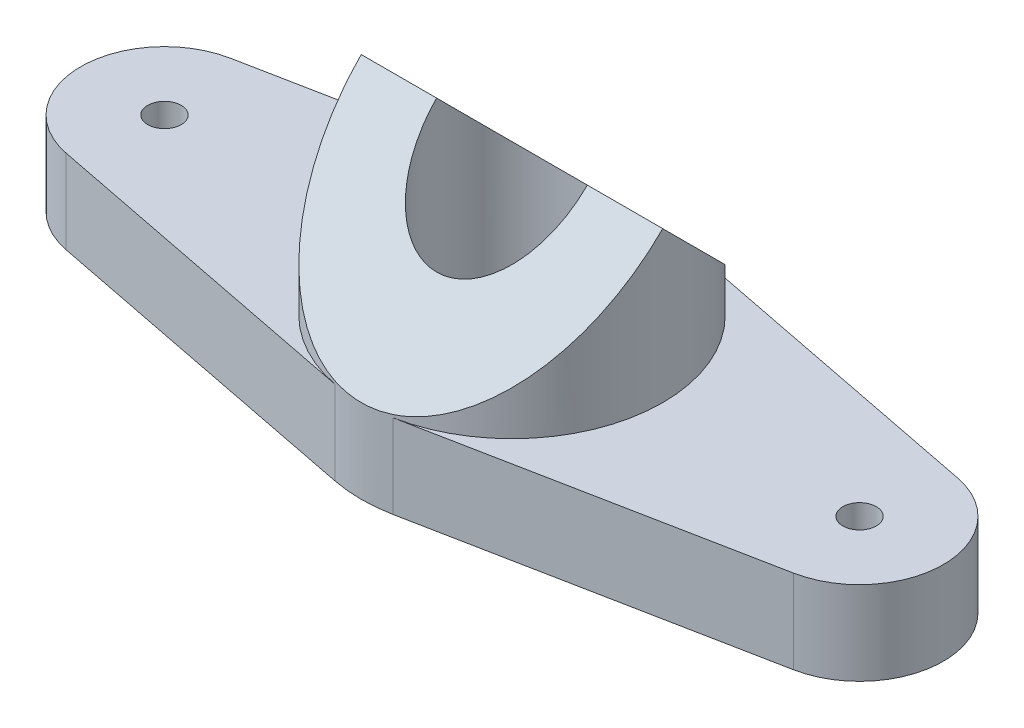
ISO-10303-21;
HEADER;
FILE_DESCRIPTION(('STEP AP214'),'2;1');
FILE_NAME('part.step','',(''),(''),'','','');
FILE_SCHEMA(('AUTOMOTIVE_DESIGN { 1 0 10303 214 1 1 1 1 }'));
ENDSEC;
DATA;
#1=APPLICATION_CONTEXT('core data for automotive mechanical design processes');
#2=APPLICATION_PROTOCOL_DEFINITION('international standard','automotive_design',2000,#1);
#3=PRODUCT_CONTEXT('',#1,'mechanical');
#4=PRODUCT('Part','Part','',(#3));
#5=PRODUCT_RELATED_PRODUCT_CATEGORY('part','',(#4));
#6=PRODUCT_DEFINITION_FORMATION('','',#4);
#7=PRODUCT_DEFINITION_CONTEXT('part definition',#1,'design');
#8=PRODUCT_DEFINITION('design','',#6,#7);
#9=PRODUCT_DEFINITION_SHAPE('','',#8);
#10=(LENGTH_UNIT() NAMED_UNIT(*) SI_UNIT(.MILLI.,.METRE.));
#11=(NAMED_UNIT(*) PLANE_ANGLE_UNIT() SI_UNIT($,.RADIAN.));
#12=(NAMED_UNIT(*) SI_UNIT($,.STERADIAN.) SOLID_ANGLE_UNIT());
#13=UNCERTAINTY_MEASURE_WITH_UNIT(LENGTH_MEASURE(1.E-05),#10,'distance_accuracy_value','');
#14=(GEOMETRIC_REPRESENTATION_CONTEXT(3) GLOBAL_UNCERTAINTY_ASSIGNED_CONTEXT((#13)) GLOBAL_UNIT_ASSIGNED_CONTEXT((#10,
#11,#12)) REPRESENTATION_CONTEXT('',''));
#15=CARTESIAN_POINT('',(0.,0.,0.));
#16=DIRECTION('',(0.,0.,1.));
#17=DIRECTION('',(1.,0.,0.));
#18=AXIS2_PLACEMENT_3D('',#15,#16,#17);
#19=CARTESIAN_POINT('',(-30.9,14.,0.));
#20=DIRECTION('',(0.,-0.707106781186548,0.707106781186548));
#21=DIRECTION('',(0.,-0.707106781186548,-0.707106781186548));
#22=AXIS2_PLACEMENT_3D('',#19,#20,#21);
#23=PLANE('',#22);
#24=DIRECTION('',(1.,0.,0.));
#25=VECTOR('',#24,1.);
#26=CARTESIAN_POINT('',(-30.9,14.,0.));
#27=LINE('',#26,#25);
#28=CARTESIAN_POINT('',(-8.99999999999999,14.,0.));
#29=VERTEX_POINT('',#28);
#30=CARTESIAN_POINT('',(-4.49999999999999,14.,0.));
#31=VERTEX_POINT('',#30);
#32=EDGE_CURVE('E317',#29,#31,#27,.T.);
#33=ORIENTED_EDGE('',*,*,#32,.T.);
#34=CARTESIAN_POINT('',(0.,14.,0.));
#35=DIRECTION('',(0.,-0.707106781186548,0.707106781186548));
#36=DIRECTION('',(0.,0.707106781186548,0.707106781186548));
#37=AXIS2_PLACEMENT_3D('',#34,#35,#36);
#38=ELLIPSE('',#37,6.36396103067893,4.5);
#39=CARTESIAN_POINT('',(4.50000000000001,14.,0.));
#40=VERTEX_POINT('',#39);
#41=EDGE_CURVE('E151',#31,#40,#38,.T.);
#42=ORIENTED_EDGE('',*,*,#41,.T.);
#43=DIRECTION('',(1.,0.,0.));
#44=VECTOR('',#43,1.);
#45=CARTESIAN_POINT('',(-30.9,14.,0.));
#46=LINE('',#45,#44);
#47=CARTESIAN_POINT('',(9.00000000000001,14.,0.));
#48=VERTEX_POINT('',#47);
#49=EDGE_CURVE('E109',#40,#48,#46,.T.);
#50=ORIENTED_EDGE('',*,*,#49,.T.);
#51=CARTESIAN_POINT('',(0.,14.,0.));
#52=DIRECTION('',(0.,-0.707106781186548,0.707106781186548));
#53=DIRECTION('',(0.,0.707106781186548,0.707106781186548));
#54=AXIS2_PLACEMENT_3D('',#51,#52,#53);
#55=ELLIPSE('',#54,12.7279220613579,9.);
#56=EDGE_CURVE('E160',#29,#48,#55,.T.);
#57=ORIENTED_EDGE('',*,*,#56,.F.);
#58=EDGE_LOOP('',(#33,#42,#50,#57));
#59=FACE_BOUND('',#58,.T.);
#60=ADVANCED_FACE('F16',(#59),#23,.F.);
#61=CARTESIAN_POINT('',(-30.9,5.,9.));
#62=DIRECTION('',(0.,-0.707106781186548,-0.707106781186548));
#63=DIRECTION('',(0.,0.707106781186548,-0.707106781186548));
#64=AXIS2_PLACEMENT_3D('',#61,#62,#63);
#65=PLANE('',#64);
#66=CARTESIAN_POINT('',(0.,14.,0.));
#67=DIRECTION('',(0.,-0.707106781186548,-0.707106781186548));
#68=DIRECTION('',(0.,0.707106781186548,-0.707106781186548));
#69=AXIS2_PLACEMENT_3D('',#66,#67,#68);
#70=ELLIPSE('',#69,6.36396103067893,4.5);
#71=EDGE_CURVE('E148',#40,#31,#70,.T.);
#72=ORIENTED_EDGE('',*,*,#71,.T.);
#73=ORIENTED_EDGE('',*,*,#32,.F.);
#74=CARTESIAN_POINT('',(0.,14.,0.));
#75=DIRECTION('',(0.,-0.707106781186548,-0.707106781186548));
#76=DIRECTION('',(0.,0.707106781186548,-0.707106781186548));
#77=AXIS2_PLACEMENT_3D('',#74,#75,#76);
#78=ELLIPSE('',#77,12.7279220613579,9.);
#79=EDGE_CURVE('E157',#48,#29,#78,.T.);
#80=ORIENTED_EDGE('',*,*,#79,.F.);
#81=ORIENTED_EDGE('',*,*,#49,.F.);
#82=EDGE_LOOP('',(#72,#73,#80,#81));
#83=FACE_BOUND('',#82,.T.);
#84=ADVANCED_FACE('F243',(#83),#65,.F.);
#85=CARTESIAN_POINT('',(0.,5.,0.));
#86=DIRECTION('',(0.,1.,0.));
#87=DIRECTION('',(0.,0.,1.));
#88=AXIS2_PLACEMENT_3D('',#85,#86,#87);
#89=PLANE('',#88);
#90=CARTESIAN_POINT('',(-20.75,5.,0.));
#91=DIRECTION('',(0.,1.,0.));
#92=DIRECTION('',(0.,0.,1.));
#93=AXIS2_PLACEMENT_3D('',#90,#91,#92);
#94=CIRCLE('',#93,1.);
#95=CARTESIAN_POINT('',(-20.75,5.,1.));
#96=VERTEX_POINT('',#95);
#97=EDGE_CURVE('E145',#96,#96,#94,.F.);
#98=ORIENTED_EDGE('',*,*,#97,.T.);
#99=EDGE_LOOP('',(#98));
#100=FACE_BOUND('',#99,.T.);
#101=DIRECTION('',(0.981243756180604,0.,0.192771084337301));
#102=VECTOR('',#101,1.);
#103=CARTESIAN_POINT('',(-21.71385542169,5.,4.906218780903));
#104=LINE('',#103,#102);
#105=CARTESIAN_POINT('',(-1.73493975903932,5.,8.83119380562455));
#106=VERTEX_POINT('',#105);
#107=CARTESIAN_POINT('',(-21.7138554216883,5.,4.90621878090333));
#108=VERTEX_POINT('',#107);
#109=EDGE_CURVE('E122',#106,#108,#104,.F.);
#110=ORIENTED_EDGE('',*,*,#109,.F.);
#111=CARTESIAN_POINT('',(0.,5.,0.));
#112=DIRECTION('',(0.,1.,0.));
#113=DIRECTION('',(0.,0.,1.));
#114=AXIS2_PLACEMENT_3D('',#111,#112,#113);
#115=CIRCLE('',#114,9.);
#116=CARTESIAN_POINT('',(-1.73493975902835,5.,-8.83119380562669));
#117=VERTEX_POINT('',#116);
#118=EDGE_CURVE('E163',#117,#106,#115,.T.);
#119=ORIENTED_EDGE('',*,*,#118,.F.);
#120=DIRECTION('',(-0.981243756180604,0.,0.192771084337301));
#121=VECTOR('',#120,1.);
#122=CARTESIAN_POINT('',(-1.734939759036,5.,-8.831193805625));
#123=LINE('',#122,#121);
#124=CARTESIAN_POINT('',(-21.7138554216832,5.,-4.90621878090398));
#125=VERTEX_POINT('',#124);
#126=EDGE_CURVE('E113',#125,#117,#123,.F.);
#127=ORIENTED_EDGE('',*,*,#126,.F.);
#128=CARTESIAN_POINT('',(-20.75,5.,0.));
#129=DIRECTION('',(0.,1.,0.));
#130=DIRECTION('',(0.,0.,1.));
#131=AXIS2_PLACEMENT_3D('',#128,#129,#130);
#132=CIRCLE('',#131,5.);
#133=EDGE_CURVE('E115',#108,#125,#132,.F.);
#134=ORIENTED_EDGE('',*,*,#133,.F.);
#135=EDGE_LOOP('',(#110,#119,#127,#134));
#136=FACE_BOUND('',#135,.T.);
#137=ADVANCED_FACE('F241',(#100,#136),#89,.T.);
#138=CARTESIAN_POINT('',(0.,5.,0.));
#139=DIRECTION('',(0.,1.,0.));
#140=DIRECTION('',(0.,0.,1.));
#141=AXIS2_PLACEMENT_3D('',#138,#139,#140);
#142=PLANE('',#141);
#143=CARTESIAN_POINT('',(20.75,5.,0.));
#144=DIRECTION('',(0.,1.,0.));
#145=DIRECTION('',(0.,0.,1.));
#146=AXIS2_PLACEMENT_3D('',#143,#144,#145);
#147=CIRCLE('',#146,1.);
#148=CARTESIAN_POINT('',(20.75,5.,1.));
#149=VERTEX_POINT('',#148);
#150=EDGE_CURVE('E142',#149,#149,#147,.F.);
#151=ORIENTED_EDGE('',*,*,#150,.T.);
#152=EDGE_LOOP('',(#151));
#153=FACE_BOUND('',#152,.T.);
#154=CARTESIAN_POINT('',(20.75,5.,0.));
#155=DIRECTION('',(0.,1.,0.));
#156=DIRECTION('',(0.,0.,1.));
#157=AXIS2_PLACEMENT_3D('',#154,#155,#156);
#158=CIRCLE('',#157,5.);
#159=CARTESIAN_POINT('',(21.7138554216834,5.,-4.90621878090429));
#160=VERTEX_POINT('',#159);
#161=CARTESIAN_POINT('',(21.7138554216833,5.,4.90621878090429));
#162=VERTEX_POINT('',#161);
#163=EDGE_CURVE('E20',#160,#162,#158,.F.);
#164=ORIENTED_EDGE('',*,*,#163,.F.);
#165=DIRECTION('',(-0.981243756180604,0.,-0.192771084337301));
#166=VECTOR('',#165,1.);
#167=CARTESIAN_POINT('',(21.71385542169,5.,-4.906218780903));
#168=LINE('',#167,#166);
#169=CARTESIAN_POINT('',(1.73493975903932,5.,-8.83119380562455));
#170=VERTEX_POINT('',#169);
#171=EDGE_CURVE('E91',#170,#160,#168,.F.);
#172=ORIENTED_EDGE('',*,*,#171,.F.);
#173=CARTESIAN_POINT('',(0.,5.,0.));
#174=DIRECTION('',(0.,1.,0.));
#175=DIRECTION('',(0.,0.,1.));
#176=AXIS2_PLACEMENT_3D('',#173,#174,#175);
#177=CIRCLE('',#176,9.);
#178=CARTESIAN_POINT('',(1.73493975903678,5.,8.83119380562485));
#179=VERTEX_POINT('',#178);
#180=EDGE_CURVE('E155',#179,#170,#177,.T.);
#181=ORIENTED_EDGE('',*,*,#180,.F.);
#182=DIRECTION('',(0.981243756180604,0.,-0.192771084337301));
#183=VECTOR('',#182,1.);
#184=CARTESIAN_POINT('',(1.734939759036,5.,8.831193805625));
#185=LINE('',#184,#183);
#186=EDGE_CURVE('E105',#162,#179,#185,.F.);
#187=ORIENTED_EDGE('',*,*,#186,.F.);
#188=EDGE_LOOP('',(#164,#172,#181,#187));
#189=FACE_BOUND('',#188,.T.);
#190=ADVANCED_FACE('F104',(#153,#189),#142,.T.);
#191=CARTESIAN_POINT('',(20.75,0.,0.));
#192=DIRECTION('',(0.,1.,0.));
#193=DIRECTION('',(0.,0.,1.));
#194=AXIS2_PLACEMENT_3D('',#191,#192,#193);
#195=CYLINDRICAL_SURFACE('',#194,5.);
#196=DIRECTION('',(0.,1.,0.));
#197=VECTOR('',#196,1.);
#198=CARTESIAN_POINT('',(21.71385542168,0.,4.90621878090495));
#199=LINE('',#198,#197);
#200=CARTESIAN_POINT('',(21.7138554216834,0.,4.90621878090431));
#201=VERTEX_POINT('',#200);
#202=EDGE_CURVE('E154',#201,#162,#199,.T.);
#203=ORIENTED_EDGE('',*,*,#202,.F.);
#204=CARTESIAN_POINT('',(20.75,0.,0.));
#205=DIRECTION('',(0.,1.,0.));
#206=DIRECTION('',(0.,0.,1.));
#207=AXIS2_PLACEMENT_3D('',#204,#205,#206);
#208=CIRCLE('',#207,5.);
#209=CARTESIAN_POINT('',(21.7138554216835,0.,-4.90621878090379));
#210=VERTEX_POINT('',#209);
#211=EDGE_CURVE('E112',#201,#210,#208,.T.);
#212=ORIENTED_EDGE('',*,*,#211,.T.);
#213=DIRECTION('',(0.,1.,0.));
#214=VECTOR('',#213,1.);
#215=CARTESIAN_POINT('',(21.7138554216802,0.,-4.90621878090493));
#216=LINE('',#215,#214);
#217=EDGE_CURVE('E96',#160,#210,#216,.F.);
#218=ORIENTED_EDGE('',*,*,#217,.F.);
#219=ORIENTED_EDGE('',*,*,#163,.T.);
#220=EDGE_LOOP('',(#203,#212,#218,#219));
#221=FACE_BOUND('',#220,.T.);
#222=ADVANCED_FACE('F111',(#221),#195,.T.);
#223=CARTESIAN_POINT('',(21.71385542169,0.,-4.906218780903));
#224=DIRECTION('',(0.192771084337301,0.,-0.981243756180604));
#225=DIRECTION('',(-0.981243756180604,0.,-0.192771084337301));
#226=AXIS2_PLACEMENT_3D('',#223,#224,#225);
#227=PLANE('',#226);
#228=DIRECTION('',(-0.981243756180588,0.,-0.192771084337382));
#229=VECTOR('',#228,1.);
#230=CARTESIAN_POINT('',(21.71385542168,0.,-4.906218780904));
#231=LINE('',#230,#229);
#232=CARTESIAN_POINT('',(1.73493975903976,0.,-8.83119380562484));
#233=VERTEX_POINT('',#232);
#234=EDGE_CURVE('E140',#210,#233,#231,.T.);
#235=ORIENTED_EDGE('',*,*,#234,.T.);
#236=DIRECTION('',(0.,1.,0.));
#237=VECTOR('',#236,1.);
#238=CARTESIAN_POINT('',(1.734939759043,0.,-8.83119380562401));
#239=LINE('',#238,#237);
#240=EDGE_CURVE('E98',#170,#233,#239,.F.);
#241=ORIENTED_EDGE('',*,*,#240,.F.);
#242=ORIENTED_EDGE('',*,*,#171,.T.);
#243=ORIENTED_EDGE('',*,*,#217,.T.);
#244=EDGE_LOOP('',(#235,#241,#242,#243));
#245=FACE_BOUND('',#244,.T.);
#246=ADVANCED_FACE('F94',(#245),#227,.T.);
#247=CARTESIAN_POINT('',(-1.734939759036,0.,-8.831193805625));
#248=DIRECTION('',(-0.192771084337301,0.,-0.981243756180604));
#249=DIRECTION('',(-0.981243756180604,0.,0.192771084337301));
#250=AXIS2_PLACEMENT_3D('',#247,#248,#249);
#251=PLANE('',#250);
#252=DIRECTION('',(-0.981243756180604,0.,0.192771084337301));
#253=VECTOR('',#252,1.);
#254=CARTESIAN_POINT('',(-1.734939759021,0.,-8.831193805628));
#255=LINE('',#254,#253);
#256=CARTESIAN_POINT('',(-1.73493975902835,0.,-8.83119380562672));
#257=VERTEX_POINT('',#256);
#258=CARTESIAN_POINT('',(-21.7138554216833,0.,-4.90621878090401));
#259=VERTEX_POINT('',#258);
#260=EDGE_CURVE('E137',#257,#259,#255,.T.);
#261=ORIENTED_EDGE('',*,*,#260,.T.);
#262=DIRECTION('',(0.,1.,0.));
#263=VECTOR('',#262,1.);
#264=CARTESIAN_POINT('',(-21.7138554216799,0.,-4.90621878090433));
#265=LINE('',#264,#263);
#266=EDGE_CURVE('E124',#125,#259,#265,.F.);
#267=ORIENTED_EDGE('',*,*,#266,.F.);
#268=ORIENTED_EDGE('',*,*,#126,.T.);
#269=DIRECTION('',(0.,1.,0.));
#270=VECTOR('',#269,1.);
#271=CARTESIAN_POINT('',(-1.73493975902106,0.,-8.83119380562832));
#272=LINE('',#271,#270);
#273=EDGE_CURVE('E164',#257,#117,#272,.T.);
#274=ORIENTED_EDGE('',*,*,#273,.F.);
#275=EDGE_LOOP('',(#261,#267,#268,#274));
#276=FACE_BOUND('',#275,.T.);
#277=ADVANCED_FACE('F190',(#276),#251,.T.);
#278=CARTESIAN_POINT('',(-20.75,0.,0.));
#279=DIRECTION('',(0.,1.,0.));
#280=DIRECTION('',(0.,0.,1.));
#281=AXIS2_PLACEMENT_3D('',#278,#279,#280);
#282=CYLINDRICAL_SURFACE('',#281,5.);
#283=ORIENTED_EDGE('',*,*,#266,.T.);
#284=CARTESIAN_POINT('',(-20.75,0.,0.));
#285=DIRECTION('',(0.,1.,0.));
#286=DIRECTION('',(0.,0.,1.));
#287=AXIS2_PLACEMENT_3D('',#284,#285,#286);
#288=CIRCLE('',#287,5.);
#289=CARTESIAN_POINT('',(-21.7138554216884,0.,4.90621878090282));
#290=VERTEX_POINT('',#289);
#291=EDGE_CURVE('E134',#259,#290,#288,.T.);
#292=ORIENTED_EDGE('',*,*,#291,.T.);
#293=DIRECTION('',(0.,1.,0.));
#294=VECTOR('',#293,1.);
#295=CARTESIAN_POINT('',(-21.71385542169,0.,4.906218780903));
#296=LINE('',#295,#294);
#297=EDGE_CURVE('E123',#108,#290,#296,.F.);
#298=ORIENTED_EDGE('',*,*,#297,.F.);
#299=ORIENTED_EDGE('',*,*,#133,.T.);
#300=EDGE_LOOP('',(#283,#292,#298,#299));
#301=FACE_BOUND('',#300,.T.);
#302=ADVANCED_FACE('F188',(#301),#282,.T.);
#303=CARTESIAN_POINT('',(-21.71385542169,0.,4.906218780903));
#304=DIRECTION('',(-0.192771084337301,0.,0.981243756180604));
#305=DIRECTION('',(0.981243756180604,0.,0.192771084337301));
#306=AXIS2_PLACEMENT_3D('',#303,#304,#305);
#307=PLANE('',#306);
#308=DIRECTION('',(0.981243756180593,0.,0.192771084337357));
#309=VECTOR('',#308,1.);
#310=CARTESIAN_POINT('',(-21.71385542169,0.,4.906218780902));
#311=LINE('',#310,#309);
#312=CARTESIAN_POINT('',(-1.7349397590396,0.,8.83119380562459));
#313=VERTEX_POINT('',#312);
#314=EDGE_CURVE('E133',#290,#313,#311,.T.);
#315=ORIENTED_EDGE('',*,*,#314,.T.);
#316=DIRECTION('',(0.,1.,0.));
#317=VECTOR('',#316,1.);
#318=CARTESIAN_POINT('',(-1.73493975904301,0.,8.83119380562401));
#319=LINE('',#318,#317);
#320=EDGE_CURVE('E162',#106,#313,#319,.F.);
#321=ORIENTED_EDGE('',*,*,#320,.F.);
#322=ORIENTED_EDGE('',*,*,#109,.T.);
#323=ORIENTED_EDGE('',*,*,#297,.T.);
#324=EDGE_LOOP('',(#315,#321,#322,#323));
#325=FACE_BOUND('',#324,.T.);
#326=ADVANCED_FACE('F180',(#325),#307,.T.);
#327=CARTESIAN_POINT('',(0.,0.,0.));
#328=DIRECTION('',(0.,1.,0.));
#329=DIRECTION('',(0.,0.,1.));
#330=AXIS2_PLACEMENT_3D('',#327,#328,#329);
#331=CYLINDRICAL_SURFACE('',#330,9.);
#332=ORIENTED_EDGE('',*,*,#79,.T.);
#333=ORIENTED_EDGE('',*,*,#56,.T.);
#334=EDGE_LOOP('',(#332,#333));
#335=FACE_BOUND('',#334,.T.);
#336=ORIENTED_EDGE('',*,*,#240,.T.);
#337=CARTESIAN_POINT('',(0.,0.,0.));
#338=DIRECTION('',(0.,1.,0.));
#339=DIRECTION('',(0.,0.,1.));
#340=AXIS2_PLACEMENT_3D('',#337,#338,#339);
#341=CIRCLE('',#340,9.);
#342=EDGE_CURVE('E138',#233,#257,#341,.T.);
#343=ORIENTED_EDGE('',*,*,#342,.T.);
#344=ORIENTED_EDGE('',*,*,#273,.T.);
#345=ORIENTED_EDGE('',*,*,#118,.T.);
#346=ORIENTED_EDGE('',*,*,#320,.T.);
#347=CARTESIAN_POINT('',(0.,0.,0.));
#348=DIRECTION('',(0.,1.,0.));
#349=DIRECTION('',(0.,0.,1.));
#350=AXIS2_PLACEMENT_3D('',#347,#348,#349);
#351=CIRCLE('',#350,9.);
#352=CARTESIAN_POINT('',(1.73493975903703,0.,8.83119380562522));
#353=VERTEX_POINT('',#352);
#354=EDGE_CURVE('E35',#313,#353,#351,.T.);
#355=ORIENTED_EDGE('',*,*,#354,.T.);
#356=DIRECTION('',(0.,1.,0.));
#357=VECTOR('',#356,1.);
#358=CARTESIAN_POINT('',(1.73493975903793,0.,8.83119380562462));
#359=LINE('',#358,#357);
#360=EDGE_CURVE('E120',#179,#353,#359,.F.);
#361=ORIENTED_EDGE('',*,*,#360,.F.);
#362=ORIENTED_EDGE('',*,*,#180,.T.);
#363=EDGE_LOOP('',(#336,#343,#344,#345,#346,#355,#361,#362));
#364=FACE_BOUND('',#363,.T.);
#365=ADVANCED_FACE('F197',(#335,#364),#331,.T.);
#366=CARTESIAN_POINT('',(1.734939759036,0.,8.831193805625));
#367=DIRECTION('',(0.192771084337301,0.,0.981243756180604));
#368=DIRECTION('',(0.981243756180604,0.,-0.192771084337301));
#369=AXIS2_PLACEMENT_3D('',#366,#367,#368);
#370=PLANE('',#369);
#371=DIRECTION('',(0.981243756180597,0.,-0.192771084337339));
#372=VECTOR('',#371,1.);
#373=CARTESIAN_POINT('',(1.73493975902,0.,8.831193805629));
#374=LINE('',#373,#372);
#375=EDGE_CURVE('E131',#353,#201,#374,.T.);
#376=ORIENTED_EDGE('',*,*,#375,.T.);
#377=ORIENTED_EDGE('',*,*,#202,.T.);
#378=ORIENTED_EDGE('',*,*,#186,.T.);
#379=ORIENTED_EDGE('',*,*,#360,.T.);
#380=EDGE_LOOP('',(#376,#377,#378,#379));
#381=FACE_BOUND('',#380,.T.);
#382=ADVANCED_FACE('F217',(#381),#370,.T.);
#383=CARTESIAN_POINT('',(0.,0.,0.));
#384=DIRECTION('',(0.,1.,0.));
#385=DIRECTION('',(0.,0.,1.));
#386=AXIS2_PLACEMENT_3D('',#383,#384,#385);
#387=CYLINDRICAL_SURFACE('',#386,4.5);
#388=ORIENTED_EDGE('',*,*,#41,.F.);
#389=ORIENTED_EDGE('',*,*,#71,.F.);
#390=EDGE_LOOP('',(#388,#389));
#391=FACE_BOUND('',#390,.T.);
#392=CARTESIAN_POINT('',(0.,0.,0.));
#393=DIRECTION('',(0.,1.,0.));
#394=DIRECTION('',(0.,0.,1.));
#395=AXIS2_PLACEMENT_3D('',#392,#393,#394);
#396=CIRCLE('',#395,4.5);
#397=CARTESIAN_POINT('',(0.,0.,4.5));
#398=VERTEX_POINT('',#397);
#399=EDGE_CURVE('E128',#398,#398,#396,.F.);
#400=ORIENTED_EDGE('',*,*,#399,.T.);
#401=EDGE_LOOP('',(#400));
#402=FACE_BOUND('',#401,.T.);
#403=ADVANCED_FACE('F215',(#391,#402),#387,.F.);
#404=CARTESIAN_POINT('',(-20.75,0.,0.));
#405=DIRECTION('',(0.,1.,0.));
#406=DIRECTION('',(0.,0.,1.));
#407=AXIS2_PLACEMENT_3D('',#404,#405,#406);
#408=CYLINDRICAL_SURFACE('',#407,1.);
#409=ORIENTED_EDGE('',*,*,#97,.F.);
#410=EDGE_LOOP('',(#409));
#411=FACE_BOUND('',#410,.T.);
#412=CARTESIAN_POINT('',(-20.75,0.,0.));
#413=DIRECTION('',(0.,1.,0.));
#414=DIRECTION('',(0.,0.,1.));
#415=AXIS2_PLACEMENT_3D('',#412,#413,#414);
#416=CIRCLE('',#415,1.);
#417=CARTESIAN_POINT('',(-20.75,0.,1.));
#418=VERTEX_POINT('',#417);
#419=EDGE_CURVE('E26',#418,#418,#416,.F.);
#420=ORIENTED_EDGE('',*,*,#419,.T.);
#421=EDGE_LOOP('',(#420));
#422=FACE_BOUND('',#421,.T.);
#423=ADVANCED_FACE('F207',(#411,#422),#408,.F.);
#424=CARTESIAN_POINT('',(20.75,0.,0.));
#425=DIRECTION('',(0.,1.,0.));
#426=DIRECTION('',(0.,0.,1.));
#427=AXIS2_PLACEMENT_3D('',#424,#425,#426);
#428=CYLINDRICAL_SURFACE('',#427,1.);
#429=ORIENTED_EDGE('',*,*,#150,.F.);
#430=EDGE_LOOP('',(#429));
#431=FACE_BOUND('',#430,.T.);
#432=CARTESIAN_POINT('',(20.75,0.,0.));
#433=DIRECTION('',(0.,1.,0.));
#434=DIRECTION('',(0.,0.,1.));
#435=AXIS2_PLACEMENT_3D('',#432,#433,#434);
#436=CIRCLE('',#435,1.);
#437=CARTESIAN_POINT('',(20.75,0.,1.));
#438=VERTEX_POINT('',#437);
#439=EDGE_CURVE('E11',#438,#438,#436,.F.);
#440=ORIENTED_EDGE('',*,*,#439,.T.);
#441=EDGE_LOOP('',(#440));
#442=FACE_BOUND('',#441,.T.);
#443=ADVANCED_FACE('F202',(#431,#442),#428,.F.);
#444=CARTESIAN_POINT('',(0.,0.,0.));
#445=DIRECTION('',(0.,1.,0.));
#446=DIRECTION('',(0.,0.,1.));
#447=AXIS2_PLACEMENT_3D('',#444,#445,#446);
#448=PLANE('',#447);
#449=ORIENTED_EDGE('',*,*,#439,.F.);
#450=EDGE_LOOP('',(#449));
#451=FACE_BOUND('',#450,.T.);
#452=ORIENTED_EDGE('',*,*,#419,.F.);
#453=EDGE_LOOP('',(#452));
#454=FACE_BOUND('',#453,.T.);
#455=ORIENTED_EDGE('',*,*,#399,.F.);
#456=EDGE_LOOP('',(#455));
#457=FACE_BOUND('',#456,.T.);
#458=ORIENTED_EDGE('',*,*,#375,.F.);
#459=ORIENTED_EDGE('',*,*,#354,.F.);
#460=ORIENTED_EDGE('',*,*,#314,.F.);
#461=ORIENTED_EDGE('',*,*,#291,.F.);
#462=ORIENTED_EDGE('',*,*,#260,.F.);
#463=ORIENTED_EDGE('',*,*,#342,.F.);
#464=ORIENTED_EDGE('',*,*,#234,.F.);
#465=ORIENTED_EDGE('',*,*,#211,.F.);
#466=EDGE_LOOP('',(#458,#459,#460,#461,#462,#463,#464,#465));
#467=FACE_BOUND('',#466,.T.);
#468=ADVANCED_FACE('F18',(#451,#454,#457,#467),#448,.F.);
#469=CLOSED_SHELL('',(#60,#84,#137,#190,#222,#246,#277,#302,#326,#365,#382,#403,#423,#443,#468));
#470=MANIFOLD_SOLID_BREP('B1',#469);
#471=ADVANCED_BREP_SHAPE_REPRESENTATION('',(#18,#470),#14);
#472=SHAPE_DEFINITION_REPRESENTATION(#9,#471);
ENDSEC;
END-ISO-10303-21;
